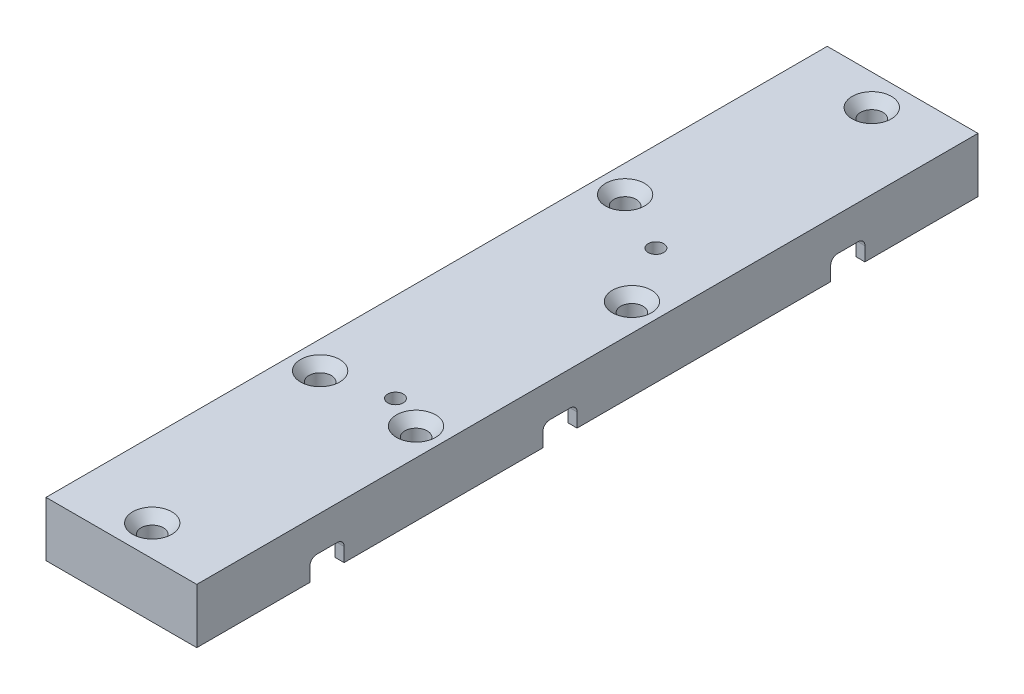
ISO-10303-21;
HEADER;
FILE_DESCRIPTION(('STEP AP214'),'2;1');
FILE_NAME('part.step','',(''),(''),'','','');
FILE_SCHEMA(('AUTOMOTIVE_DESIGN { 1 0 10303 214 1 1 1 1 }'));
ENDSEC;
DATA;
#1=APPLICATION_CONTEXT('core data for automotive mechanical design processes');
#2=APPLICATION_PROTOCOL_DEFINITION('international standard','automotive_design',2000,#1);
#3=PRODUCT_CONTEXT('',#1,'mechanical');
#4=PRODUCT('Part','Part','',(#3));
#5=PRODUCT_RELATED_PRODUCT_CATEGORY('part','',(#4));
#6=PRODUCT_DEFINITION_FORMATION('','',#4);
#7=PRODUCT_DEFINITION_CONTEXT('part definition',#1,'design');
#8=PRODUCT_DEFINITION('design','',#6,#7);
#9=PRODUCT_DEFINITION_SHAPE('','',#8);
#10=(LENGTH_UNIT() NAMED_UNIT(*) SI_UNIT(.MILLI.,.METRE.));
#11=(NAMED_UNIT(*) PLANE_ANGLE_UNIT() SI_UNIT($,.RADIAN.));
#12=(NAMED_UNIT(*) SI_UNIT($,.STERADIAN.) SOLID_ANGLE_UNIT());
#13=UNCERTAINTY_MEASURE_WITH_UNIT(LENGTH_MEASURE(1.E-05),#10,'distance_accuracy_value','');
#14=(GEOMETRIC_REPRESENTATION_CONTEXT(3) GLOBAL_UNCERTAINTY_ASSIGNED_CONTEXT((#13)) GLOBAL_UNIT_ASSIGNED_CONTEXT((#10,
#11,#12)) REPRESENTATION_CONTEXT('',''));
#15=CARTESIAN_POINT('',(0.,0.,0.));
#16=DIRECTION('',(0.,0.,1.));
#17=DIRECTION('',(1.,0.,0.));
#18=AXIS2_PLACEMENT_3D('',#15,#16,#17);
#19=CARTESIAN_POINT('',(11.,0.,-114.));
#20=DIRECTION('',(-1.,0.,0.));
#21=DIRECTION('',(0.,-1.,0.));
#22=AXIS2_PLACEMENT_3D('',#19,#20,#21);
#23=PLANE('',#22);
#24=DIRECTION('',(0.,-1.,0.));
#25=VECTOR('',#24,1.);
#26=CARTESIAN_POINT('',(11.,-4.952,-92.5));
#27=LINE('',#26,#25);
#28=CARTESIAN_POINT('',(11.,-5.952,-92.5));
#29=VERTEX_POINT('',#28);
#30=CARTESIAN_POINT('',(11.,-8.,-92.5));
#31=VERTEX_POINT('',#30);
#32=EDGE_CURVE('E201',#29,#31,#27,.T.);
#33=ORIENTED_EDGE('',*,*,#32,.F.);
#34=CARTESIAN_POINT('',(11.,-5.952,-93.5));
#35=DIRECTION('',(-1.,0.,0.));
#36=DIRECTION('',(0.,-1.,0.));
#37=AXIS2_PLACEMENT_3D('',#34,#35,#36);
#38=CIRCLE('',#37,1.);
#39=CARTESIAN_POINT('',(11.,-4.952,-93.5));
#40=VERTEX_POINT('',#39);
#41=EDGE_CURVE('E517',#29,#40,#38,.T.);
#42=ORIENTED_EDGE('',*,*,#41,.T.);
#43=DIRECTION('',(0.,0.,-1.));
#44=VECTOR('',#43,1.);
#45=CARTESIAN_POINT('',(11.,-4.952,-92.5));
#46=LINE('',#45,#44);
#47=CARTESIAN_POINT('',(11.,-4.952,-96.5));
#48=VERTEX_POINT('',#47);
#49=EDGE_CURVE('E328',#40,#48,#46,.T.);
#50=ORIENTED_EDGE('',*,*,#49,.T.);
#51=CARTESIAN_POINT('',(11.,-5.952,-96.5));
#52=DIRECTION('',(-1.,0.,0.));
#53=DIRECTION('',(0.,-1.,0.));
#54=AXIS2_PLACEMENT_3D('',#51,#52,#53);
#55=CIRCLE('',#54,1.);
#56=CARTESIAN_POINT('',(11.,-5.952,-97.5));
#57=VERTEX_POINT('',#56);
#58=EDGE_CURVE('E544',#48,#57,#55,.T.);
#59=ORIENTED_EDGE('',*,*,#58,.T.);
#60=DIRECTION('',(0.,-1.,0.));
#61=VECTOR('',#60,1.);
#62=CARTESIAN_POINT('',(11.,-4.952,-97.5));
#63=LINE('',#62,#61);
#64=CARTESIAN_POINT('',(11.,-8.,-97.5));
#65=VERTEX_POINT('',#64);
#66=EDGE_CURVE('E211',#57,#65,#63,.T.);
#67=ORIENTED_EDGE('',*,*,#66,.T.);
#68=DIRECTION('',(0.,0.,1.));
#69=VECTOR('',#68,1.);
#70=CARTESIAN_POINT('',(11.,-8.,-114.));
#71=LINE('',#70,#69);
#72=CARTESIAN_POINT('',(11.,-8.,-114.));
#73=VERTEX_POINT('',#72);
#74=EDGE_CURVE('E226',#73,#65,#71,.T.);
#75=ORIENTED_EDGE('',*,*,#74,.F.);
#76=DIRECTION('',(0.,-1.,0.));
#77=VECTOR('',#76,1.);
#78=CARTESIAN_POINT('',(11.,0.,-114.));
#79=LINE('',#78,#77);
#80=CARTESIAN_POINT('',(11.,0.,-114.));
#81=VERTEX_POINT('',#80);
#82=EDGE_CURVE('E246',#81,#73,#79,.T.);
#83=ORIENTED_EDGE('',*,*,#82,.F.);
#84=DIRECTION('',(0.,0.,1.));
#85=VECTOR('',#84,1.);
#86=CARTESIAN_POINT('',(11.,0.,-114.));
#87=LINE('',#86,#85);
#88=CARTESIAN_POINT('',(11.,0.,0.));
#89=VERTEX_POINT('',#88);
#90=EDGE_CURVE('E231',#81,#89,#87,.T.);
#91=ORIENTED_EDGE('',*,*,#90,.T.);
#92=DIRECTION('',(0.,-1.,0.));
#93=VECTOR('',#92,1.);
#94=CARTESIAN_POINT('',(11.,0.,0.));
#95=LINE('',#94,#93);
#96=CARTESIAN_POINT('',(11.,-8.,0.));
#97=VERTEX_POINT('',#96);
#98=EDGE_CURVE('E253',#89,#97,#95,.T.);
#99=ORIENTED_EDGE('',*,*,#98,.T.);
#100=CARTESIAN_POINT('',(11.,-8.,-16.5));
#101=VERTEX_POINT('',#100);
#102=EDGE_CURVE('E229',#101,#97,#71,.T.);
#103=ORIENTED_EDGE('',*,*,#102,.F.);
#104=DIRECTION('',(0.,-1.,0.));
#105=VECTOR('',#104,1.);
#106=CARTESIAN_POINT('',(11.,-4.952,-16.5));
#107=LINE('',#106,#105);
#108=CARTESIAN_POINT('',(11.,-5.952,-16.5));
#109=VERTEX_POINT('',#108);
#110=EDGE_CURVE('E299',#109,#101,#107,.T.);
#111=ORIENTED_EDGE('',*,*,#110,.F.);
#112=CARTESIAN_POINT('',(11.,-5.952,-17.5));
#113=DIRECTION('',(-1.,0.,0.));
#114=DIRECTION('',(0.,-1.,0.));
#115=AXIS2_PLACEMENT_3D('',#112,#113,#114);
#116=CIRCLE('',#115,1.);
#117=CARTESIAN_POINT('',(11.,-4.952,-17.5));
#118=VERTEX_POINT('',#117);
#119=EDGE_CURVE('E463',#109,#118,#116,.T.);
#120=ORIENTED_EDGE('',*,*,#119,.T.);
#121=DIRECTION('',(0.,0.,-1.));
#122=VECTOR('',#121,1.);
#123=CARTESIAN_POINT('',(11.,-4.952,-16.5));
#124=LINE('',#123,#122);
#125=CARTESIAN_POINT('',(11.,-4.952,-20.5));
#126=VERTEX_POINT('',#125);
#127=EDGE_CURVE('E313',#118,#126,#124,.T.);
#128=ORIENTED_EDGE('',*,*,#127,.T.);
#129=CARTESIAN_POINT('',(11.,-5.952,-20.5));
#130=DIRECTION('',(-1.,0.,0.));
#131=DIRECTION('',(0.,-1.,0.));
#132=AXIS2_PLACEMENT_3D('',#129,#130,#131);
#133=CIRCLE('',#132,1.);
#134=CARTESIAN_POINT('',(11.,-5.952,-21.5));
#135=VERTEX_POINT('',#134);
#136=EDGE_CURVE('E545',#126,#135,#133,.T.);
#137=ORIENTED_EDGE('',*,*,#136,.T.);
#138=DIRECTION('',(0.,-1.,0.));
#139=VECTOR('',#138,1.);
#140=CARTESIAN_POINT('',(11.,-4.952,-21.5));
#141=LINE('',#140,#139);
#142=CARTESIAN_POINT('',(11.,-8.,-21.5));
#143=VERTEX_POINT('',#142);
#144=EDGE_CURVE('E303',#135,#143,#141,.T.);
#145=ORIENTED_EDGE('',*,*,#144,.T.);
#146=CARTESIAN_POINT('',(11.,-8.,-50.5));
#147=VERTEX_POINT('',#146);
#148=EDGE_CURVE('E227',#147,#143,#71,.T.);
#149=ORIENTED_EDGE('',*,*,#148,.F.);
#150=DIRECTION('',(0.,-1.,0.));
#151=VECTOR('',#150,1.);
#152=CARTESIAN_POINT('',(11.,-4.952,-50.5));
#153=LINE('',#152,#151);
#154=CARTESIAN_POINT('',(11.,-5.952,-50.5));
#155=VERTEX_POINT('',#154);
#156=EDGE_CURVE('E254',#155,#147,#153,.T.);
#157=ORIENTED_EDGE('',*,*,#156,.F.);
#158=CARTESIAN_POINT('',(11.,-5.952,-51.5));
#159=DIRECTION('',(-1.,0.,0.));
#160=DIRECTION('',(0.,-1.,0.));
#161=AXIS2_PLACEMENT_3D('',#158,#159,#160);
#162=CIRCLE('',#161,1.);
#163=CARTESIAN_POINT('',(11.,-4.952,-51.5));
#164=VERTEX_POINT('',#163);
#165=EDGE_CURVE('E511',#155,#164,#162,.T.);
#166=ORIENTED_EDGE('',*,*,#165,.T.);
#167=DIRECTION('',(0.,0.,-1.));
#168=VECTOR('',#167,1.);
#169=CARTESIAN_POINT('',(11.,-4.952,-50.5));
#170=LINE('',#169,#168);
#171=CARTESIAN_POINT('',(11.,-4.952,-54.5));
#172=VERTEX_POINT('',#171);
#173=EDGE_CURVE('E293',#164,#172,#170,.T.);
#174=ORIENTED_EDGE('',*,*,#173,.T.);
#175=CARTESIAN_POINT('',(11.,-5.952,-54.5));
#176=DIRECTION('',(-1.,0.,0.));
#177=DIRECTION('',(0.,-1.,0.));
#178=AXIS2_PLACEMENT_3D('',#175,#176,#177);
#179=CIRCLE('',#178,1.);
#180=CARTESIAN_POINT('',(11.,-5.952,-55.5));
#181=VERTEX_POINT('',#180);
#182=EDGE_CURVE('E13',#172,#181,#179,.T.);
#183=ORIENTED_EDGE('',*,*,#182,.T.);
#184=DIRECTION('',(0.,-1.,0.));
#185=VECTOR('',#184,1.);
#186=CARTESIAN_POINT('',(11.,-4.952,-55.5));
#187=LINE('',#186,#185);
#188=CARTESIAN_POINT('',(11.,-8.,-55.5));
#189=VERTEX_POINT('',#188);
#190=EDGE_CURVE('E225',#181,#189,#187,.T.);
#191=ORIENTED_EDGE('',*,*,#190,.T.);
#192=EDGE_CURVE('E217',#31,#189,#71,.T.);
#193=ORIENTED_EDGE('',*,*,#192,.F.);
#194=EDGE_LOOP('',(#33,#42,#50,#59,#67,#75,#83,#91,#99,#103,#111,#120,#128,#137,#145,#149,#157,
#166,#174,#183,#191,#193));
#195=FACE_BOUND('',#194,.T.);
#196=ADVANCED_FACE('F50',(#195),#23,.F.);
#197=CARTESIAN_POINT('',(-11.,-8.,-114.));
#198=DIRECTION('',(0.,-1.,0.));
#199=DIRECTION('',(1.,0.,0.));
#200=AXIS2_PLACEMENT_3D('',#197,#198,#199);
#201=PLANE('',#200);
#202=CARTESIAN_POINT('',(1.99999999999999,-8.,-76.));
#203=DIRECTION('',(0.,1.,0.));
#204=DIRECTION('',(0.,0.,1.));
#205=AXIS2_PLACEMENT_3D('',#202,#203,#204);
#206=CIRCLE('',#205,1.1303);
#207=CARTESIAN_POINT('',(1.99999999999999,-8.,-74.8697));
#208=VERTEX_POINT('',#207);
#209=EDGE_CURVE('E392',#208,#208,#206,.T.);
#210=ORIENTED_EDGE('',*,*,#209,.T.);
#211=EDGE_LOOP('',(#210));
#212=FACE_BOUND('',#211,.T.);
#213=CARTESIAN_POINT('',(1.99999999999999,-8.,-38.));
#214=DIRECTION('',(0.,1.,0.));
#215=DIRECTION('',(0.,0.,1.));
#216=AXIS2_PLACEMENT_3D('',#213,#214,#215);
#217=CIRCLE('',#216,1.1303);
#218=CARTESIAN_POINT('',(1.99999999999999,-8.,-36.8697));
#219=VERTEX_POINT('',#218);
#220=EDGE_CURVE('E386',#219,#219,#217,.T.);
#221=ORIENTED_EDGE('',*,*,#220,.T.);
#222=EDGE_LOOP('',(#221));
#223=FACE_BOUND('',#222,.T.);
#224=CARTESIAN_POINT('',(0.,-8.,-4.5));
#225=DIRECTION('',(0.,1.,0.));
#226=DIRECTION('',(0.,0.,1.));
#227=AXIS2_PLACEMENT_3D('',#224,#225,#226);
#228=CIRCLE('',#227,1.63195);
#229=CARTESIAN_POINT('',(0.,-8.,-2.86805));
#230=VERTEX_POINT('',#229);
#231=EDGE_CURVE('E377',#230,#230,#228,.T.);
#232=ORIENTED_EDGE('',*,*,#231,.T.);
#233=EDGE_LOOP('',(#232));
#234=FACE_BOUND('',#233,.T.);
#235=CARTESIAN_POINT('',(0.,-8.,-109.5));
#236=DIRECTION('',(0.,1.,0.));
#237=DIRECTION('',(0.,0.,1.));
#238=AXIS2_PLACEMENT_3D('',#235,#236,#237);
#239=CIRCLE('',#238,1.63195);
#240=CARTESIAN_POINT('',(0.,-8.,-107.86805));
#241=VERTEX_POINT('',#240);
#242=EDGE_CURVE('E368',#241,#241,#239,.T.);
#243=ORIENTED_EDGE('',*,*,#242,.T.);
#244=EDGE_LOOP('',(#243));
#245=FACE_BOUND('',#244,.T.);
#246=CARTESIAN_POINT('',(7.,-8.,-36.));
#247=DIRECTION('',(0.,1.,0.));
#248=DIRECTION('',(0.,0.,1.));
#249=AXIS2_PLACEMENT_3D('',#246,#247,#248);
#250=CIRCLE('',#249,1.63195);
#251=CARTESIAN_POINT('',(7.,-8.,-34.36805));
#252=VERTEX_POINT('',#251);
#253=EDGE_CURVE('E359',#252,#252,#250,.T.);
#254=ORIENTED_EDGE('',*,*,#253,.T.);
#255=EDGE_LOOP('',(#254));
#256=FACE_BOUND('',#255,.T.);
#257=CARTESIAN_POINT('',(-7.,-8.,-80.5));
#258=DIRECTION('',(0.,1.,0.));
#259=DIRECTION('',(0.,0.,1.));
#260=AXIS2_PLACEMENT_3D('',#257,#258,#259);
#261=CIRCLE('',#260,1.63195);
#262=CARTESIAN_POINT('',(-7.,-8.,-78.86805));
#263=VERTEX_POINT('',#262);
#264=EDGE_CURVE('E350',#263,#263,#261,.T.);
#265=ORIENTED_EDGE('',*,*,#264,.T.);
#266=EDGE_LOOP('',(#265));
#267=FACE_BOUND('',#266,.T.);
#268=CARTESIAN_POINT('',(7.,-8.,-67.5));
#269=DIRECTION('',(0.,1.,0.));
#270=DIRECTION('',(0.,0.,1.));
#271=AXIS2_PLACEMENT_3D('',#268,#269,#270);
#272=CIRCLE('',#271,1.63195);
#273=CARTESIAN_POINT('',(7.,-8.,-65.86805));
#274=VERTEX_POINT('',#273);
#275=EDGE_CURVE('E341',#274,#274,#272,.T.);
#276=ORIENTED_EDGE('',*,*,#275,.T.);
#277=EDGE_LOOP('',(#276));
#278=FACE_BOUND('',#277,.T.);
#279=CARTESIAN_POINT('',(-7.,-8.,-36.));
#280=DIRECTION('',(0.,1.,0.));
#281=DIRECTION('',(0.,0.,1.));
#282=AXIS2_PLACEMENT_3D('',#279,#280,#281);
#283=CIRCLE('',#282,1.63195);
#284=CARTESIAN_POINT('',(-7.,-8.,-34.36805));
#285=VERTEX_POINT('',#284);
#286=EDGE_CURVE('E223',#285,#285,#283,.T.);
#287=ORIENTED_EDGE('',*,*,#286,.T.);
#288=EDGE_LOOP('',(#287));
#289=FACE_BOUND('',#288,.T.);
#290=CARTESIAN_POINT('',(0.,-8.,-95.));
#291=DIRECTION('',(0.,1.,0.));
#292=DIRECTION('',(-1.,0.,0.));
#293=AXIS2_PLACEMENT_3D('',#290,#291,#292);
#294=CIRCLE('',#293,10.);
#295=CARTESIAN_POINT('',(9.68245836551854,-8.,-97.5));
#296=VERTEX_POINT('',#295);
#297=CARTESIAN_POINT('',(9.68245836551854,-8.,-92.5));
#298=VERTEX_POINT('',#297);
#299=EDGE_CURVE('E221',#296,#298,#294,.T.);
#300=ORIENTED_EDGE('',*,*,#299,.T.);
#301=DIRECTION('',(1.,0.,0.));
#302=VECTOR('',#301,1.);
#303=CARTESIAN_POINT('',(9.68245836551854,-8.,-92.5));
#304=LINE('',#303,#302);
#305=EDGE_CURVE('E205',#298,#31,#304,.T.);
#306=ORIENTED_EDGE('',*,*,#305,.T.);
#307=ORIENTED_EDGE('',*,*,#192,.T.);
#308=DIRECTION('',(-1.,0.,0.));
#309=VECTOR('',#308,1.);
#310=CARTESIAN_POINT('',(11.,-8.,-55.5));
#311=LINE('',#310,#309);
#312=CARTESIAN_POINT('',(9.68245836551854,-8.,-55.5));
#313=VERTEX_POINT('',#312);
#314=EDGE_CURVE('E294',#189,#313,#311,.T.);
#315=ORIENTED_EDGE('',*,*,#314,.T.);
#316=CARTESIAN_POINT('',(0.,-8.,-53.));
#317=DIRECTION('',(0.,1.,0.));
#318=DIRECTION('',(-1.,0.,0.));
#319=AXIS2_PLACEMENT_3D('',#316,#317,#318);
#320=CIRCLE('',#319,10.);
#321=CARTESIAN_POINT('',(9.68245836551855,-8.,-50.5));
#322=VERTEX_POINT('',#321);
#323=EDGE_CURVE('E290',#313,#322,#320,.T.);
#324=ORIENTED_EDGE('',*,*,#323,.T.);
#325=DIRECTION('',(1.,0.,0.));
#326=VECTOR('',#325,1.);
#327=CARTESIAN_POINT('',(9.68245836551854,-8.,-50.5));
#328=LINE('',#327,#326);
#329=EDGE_CURVE('E296',#322,#147,#328,.T.);
#330=ORIENTED_EDGE('',*,*,#329,.T.);
#331=ORIENTED_EDGE('',*,*,#148,.T.);
#332=DIRECTION('',(-1.,0.,0.));
#333=VECTOR('',#332,1.);
#334=CARTESIAN_POINT('',(11.,-8.,-21.5));
#335=LINE('',#334,#333);
#336=CARTESIAN_POINT('',(9.68245836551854,-8.,-21.5));
#337=VERTEX_POINT('',#336);
#338=EDGE_CURVE('E314',#143,#337,#335,.T.);
#339=ORIENTED_EDGE('',*,*,#338,.T.);
#340=CARTESIAN_POINT('',(0.,-8.,-19.));
#341=DIRECTION('',(0.,1.,0.));
#342=DIRECTION('',(-1.,0.,0.));
#343=AXIS2_PLACEMENT_3D('',#340,#341,#342);
#344=CIRCLE('',#343,10.);
#345=CARTESIAN_POINT('',(9.68245836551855,-8.,-16.5));
#346=VERTEX_POINT('',#345);
#347=EDGE_CURVE('E310',#337,#346,#344,.T.);
#348=ORIENTED_EDGE('',*,*,#347,.T.);
#349=DIRECTION('',(1.,0.,0.));
#350=VECTOR('',#349,1.);
#351=CARTESIAN_POINT('',(9.68245836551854,-8.,-16.5));
#352=LINE('',#351,#350);
#353=EDGE_CURVE('E210',#346,#101,#352,.T.);
#354=ORIENTED_EDGE('',*,*,#353,.T.);
#355=ORIENTED_EDGE('',*,*,#102,.T.);
#356=DIRECTION('',(1.,0.,0.));
#357=VECTOR('',#356,1.);
#358=CARTESIAN_POINT('',(-11.,-8.,0.));
#359=LINE('',#358,#357);
#360=CARTESIAN_POINT('',(-11.,-8.,0.));
#361=VERTEX_POINT('',#360);
#362=EDGE_CURVE('E250',#361,#97,#359,.T.);
#363=ORIENTED_EDGE('',*,*,#362,.F.);
#364=DIRECTION('',(0.,0.,1.));
#365=VECTOR('',#364,1.);
#366=CARTESIAN_POINT('',(-11.,-8.,-114.));
#367=LINE('',#366,#365);
#368=CARTESIAN_POINT('',(-11.,-8.,-114.));
#369=VERTEX_POINT('',#368);
#370=EDGE_CURVE('E261',#369,#361,#367,.T.);
#371=ORIENTED_EDGE('',*,*,#370,.F.);
#372=DIRECTION('',(1.,0.,0.));
#373=VECTOR('',#372,1.);
#374=CARTESIAN_POINT('',(-11.,-8.,-114.));
#375=LINE('',#374,#373);
#376=EDGE_CURVE('E260',#369,#73,#375,.T.);
#377=ORIENTED_EDGE('',*,*,#376,.T.);
#378=ORIENTED_EDGE('',*,*,#74,.T.);
#379=DIRECTION('',(-1.,0.,0.));
#380=VECTOR('',#379,1.);
#381=CARTESIAN_POINT('',(11.,-8.,-97.5));
#382=LINE('',#381,#380);
#383=EDGE_CURVE('E222',#65,#296,#382,.T.);
#384=ORIENTED_EDGE('',*,*,#383,.T.);
#385=EDGE_LOOP('',(#300,#306,#307,#315,#324,#330,#331,#339,#348,#354,#355,#363,#371,#377,#378,#384));
#386=FACE_BOUND('',#385,.T.);
#387=ADVANCED_FACE('F215',(#212,#223,#234,#245,#256,#267,#278,#289,#386),#201,.T.);
#388=CARTESIAN_POINT('',(-11.,-8.,-114.));
#389=DIRECTION('',(1.,0.,0.));
#390=DIRECTION('',(0.,1.,0.));
#391=AXIS2_PLACEMENT_3D('',#388,#389,#390);
#392=PLANE('',#391);
#393=DIRECTION('',(0.,1.,0.));
#394=VECTOR('',#393,1.);
#395=CARTESIAN_POINT('',(-11.,-8.,0.));
#396=LINE('',#395,#394);
#397=CARTESIAN_POINT('',(-11.,0.,0.));
#398=VERTEX_POINT('',#397);
#399=EDGE_CURVE('E258',#361,#398,#396,.T.);
#400=ORIENTED_EDGE('',*,*,#399,.T.);
#401=DIRECTION('',(0.,0.,1.));
#402=VECTOR('',#401,1.);
#403=CARTESIAN_POINT('',(-11.,0.,-114.));
#404=LINE('',#403,#402);
#405=CARTESIAN_POINT('',(-11.,0.,-114.));
#406=VERTEX_POINT('',#405);
#407=EDGE_CURVE('E264',#406,#398,#404,.T.);
#408=ORIENTED_EDGE('',*,*,#407,.F.);
#409=DIRECTION('',(0.,1.,0.));
#410=VECTOR('',#409,1.);
#411=CARTESIAN_POINT('',(-11.,-8.,-114.));
#412=LINE('',#411,#410);
#413=EDGE_CURVE('E235',#369,#406,#412,.T.);
#414=ORIENTED_EDGE('',*,*,#413,.F.);
#415=ORIENTED_EDGE('',*,*,#370,.T.);
#416=EDGE_LOOP('',(#400,#408,#414,#415));
#417=FACE_BOUND('',#416,.T.);
#418=ADVANCED_FACE('F279',(#417),#392,.F.);
#419=CARTESIAN_POINT('',(-11.,0.,-114.));
#420=DIRECTION('',(0.,-1.,0.));
#421=DIRECTION('',(1.,0.,0.));
#422=AXIS2_PLACEMENT_3D('',#419,#420,#421);
#423=PLANE('',#422);
#424=CARTESIAN_POINT('',(1.99999999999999,0.,-76.));
#425=DIRECTION('',(0.,1.,0.));
#426=DIRECTION('',(0.,0.,1.));
#427=AXIS2_PLACEMENT_3D('',#424,#425,#426);
#428=CIRCLE('',#427,1.1303);
#429=CARTESIAN_POINT('',(1.99999999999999,0.,-74.8697));
#430=VERTEX_POINT('',#429);
#431=EDGE_CURVE('E395',#430,#430,#428,.T.);
#432=ORIENTED_EDGE('',*,*,#431,.F.);
#433=EDGE_LOOP('',(#432));
#434=FACE_BOUND('',#433,.T.);
#435=CARTESIAN_POINT('',(1.99999999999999,0.,-38.));
#436=DIRECTION('',(0.,1.,0.));
#437=DIRECTION('',(0.,0.,1.));
#438=AXIS2_PLACEMENT_3D('',#435,#436,#437);
#439=CIRCLE('',#438,1.1303);
#440=CARTESIAN_POINT('',(1.99999999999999,0.,-36.8697));
#441=VERTEX_POINT('',#440);
#442=EDGE_CURVE('E389',#441,#441,#439,.T.);
#443=ORIENTED_EDGE('',*,*,#442,.F.);
#444=EDGE_LOOP('',(#443));
#445=FACE_BOUND('',#444,.T.);
#446=CARTESIAN_POINT('',(0.,0.,-4.5));
#447=DIRECTION('',(0.,1.,0.));
#448=DIRECTION('',(0.,0.,1.));
#449=AXIS2_PLACEMENT_3D('',#446,#447,#448);
#450=CIRCLE('',#449,2.8575);
#451=CARTESIAN_POINT('',(0.,0.,-1.6425));
#452=VERTEX_POINT('',#451);
#453=EDGE_CURVE('E383',#452,#452,#450,.T.);
#454=ORIENTED_EDGE('',*,*,#453,.F.);
#455=EDGE_LOOP('',(#454));
#456=FACE_BOUND('',#455,.T.);
#457=CARTESIAN_POINT('',(0.,0.,-109.5));
#458=DIRECTION('',(0.,1.,0.));
#459=DIRECTION('',(0.,0.,1.));
#460=AXIS2_PLACEMENT_3D('',#457,#458,#459);
#461=CIRCLE('',#460,2.8575);
#462=CARTESIAN_POINT('',(0.,0.,-106.6425));
#463=VERTEX_POINT('',#462);
#464=EDGE_CURVE('E374',#463,#463,#461,.T.);
#465=ORIENTED_EDGE('',*,*,#464,.F.);
#466=EDGE_LOOP('',(#465));
#467=FACE_BOUND('',#466,.T.);
#468=CARTESIAN_POINT('',(7.,0.,-36.));
#469=DIRECTION('',(0.,1.,0.));
#470=DIRECTION('',(0.,0.,1.));
#471=AXIS2_PLACEMENT_3D('',#468,#469,#470);
#472=CIRCLE('',#471,2.8575);
#473=CARTESIAN_POINT('',(7.,0.,-33.1425));
#474=VERTEX_POINT('',#473);
#475=EDGE_CURVE('E365',#474,#474,#472,.T.);
#476=ORIENTED_EDGE('',*,*,#475,.F.);
#477=EDGE_LOOP('',(#476));
#478=FACE_BOUND('',#477,.T.);
#479=CARTESIAN_POINT('',(-7.,0.,-80.5));
#480=DIRECTION('',(0.,1.,0.));
#481=DIRECTION('',(0.,0.,1.));
#482=AXIS2_PLACEMENT_3D('',#479,#480,#481);
#483=CIRCLE('',#482,2.8575);
#484=CARTESIAN_POINT('',(-7.,0.,-77.6425));
#485=VERTEX_POINT('',#484);
#486=EDGE_CURVE('E356',#485,#485,#483,.T.);
#487=ORIENTED_EDGE('',*,*,#486,.F.);
#488=EDGE_LOOP('',(#487));
#489=FACE_BOUND('',#488,.T.);
#490=CARTESIAN_POINT('',(7.,0.,-67.5));
#491=DIRECTION('',(0.,1.,0.));
#492=DIRECTION('',(0.,0.,1.));
#493=AXIS2_PLACEMENT_3D('',#490,#491,#492);
#494=CIRCLE('',#493,2.8575);
#495=CARTESIAN_POINT('',(7.,0.,-64.6425));
#496=VERTEX_POINT('',#495);
#497=EDGE_CURVE('E347',#496,#496,#494,.T.);
#498=ORIENTED_EDGE('',*,*,#497,.F.);
#499=EDGE_LOOP('',(#498));
#500=FACE_BOUND('',#499,.T.);
#501=CARTESIAN_POINT('',(-7.,0.,-36.));
#502=DIRECTION('',(0.,1.,0.));
#503=DIRECTION('',(0.,0.,1.));
#504=AXIS2_PLACEMENT_3D('',#501,#502,#503);
#505=CIRCLE('',#504,2.8575);
#506=CARTESIAN_POINT('',(-7.,0.,-33.1425));
#507=VERTEX_POINT('',#506);
#508=EDGE_CURVE('E338',#507,#507,#505,.T.);
#509=ORIENTED_EDGE('',*,*,#508,.F.);
#510=EDGE_LOOP('',(#509));
#511=FACE_BOUND('',#510,.T.);
#512=DIRECTION('',(1.,0.,0.));
#513=VECTOR('',#512,1.);
#514=CARTESIAN_POINT('',(-11.,0.,0.));
#515=LINE('',#514,#513);
#516=EDGE_CURVE('E256',#398,#89,#515,.T.);
#517=ORIENTED_EDGE('',*,*,#516,.T.);
#518=ORIENTED_EDGE('',*,*,#90,.F.);
#519=DIRECTION('',(1.,0.,0.));
#520=VECTOR('',#519,1.);
#521=CARTESIAN_POINT('',(-11.,0.,-114.));
#522=LINE('',#521,#520);
#523=EDGE_CURVE('E240',#406,#81,#522,.T.);
#524=ORIENTED_EDGE('',*,*,#523,.F.);
#525=ORIENTED_EDGE('',*,*,#407,.T.);
#526=EDGE_LOOP('',(#517,#518,#524,#525));
#527=FACE_BOUND('',#526,.T.);
#528=ADVANCED_FACE('F401',(#434,#445,#456,#467,#478,#489,#500,#511,#527),#423,.F.);
#529=CARTESIAN_POINT('',(0.,0.,-114.));
#530=DIRECTION('',(0.,0.,-1.));
#531=DIRECTION('',(-1.,0.,0.));
#532=AXIS2_PLACEMENT_3D('',#529,#530,#531);
#533=PLANE('',#532);
#534=ORIENTED_EDGE('',*,*,#376,.F.);
#535=ORIENTED_EDGE('',*,*,#413,.T.);
#536=ORIENTED_EDGE('',*,*,#523,.T.);
#537=ORIENTED_EDGE('',*,*,#82,.T.);
#538=EDGE_LOOP('',(#534,#535,#536,#537));
#539=FACE_BOUND('',#538,.T.);
#540=ADVANCED_FACE('F280',(#539),#533,.T.);
#541=CARTESIAN_POINT('',(0.,0.,0.));
#542=DIRECTION('',(0.,0.,-1.));
#543=DIRECTION('',(-1.,0.,0.));
#544=AXIS2_PLACEMENT_3D('',#541,#542,#543);
#545=PLANE('',#544);
#546=ORIENTED_EDGE('',*,*,#362,.T.);
#547=ORIENTED_EDGE('',*,*,#98,.F.);
#548=ORIENTED_EDGE('',*,*,#516,.F.);
#549=ORIENTED_EDGE('',*,*,#399,.F.);
#550=EDGE_LOOP('',(#546,#547,#548,#549));
#551=FACE_BOUND('',#550,.T.);
#552=ADVANCED_FACE('F275',(#551),#545,.F.);
#553=CARTESIAN_POINT('',(9.68245836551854,-4.952,-50.5));
#554=DIRECTION('',(0.,0.,-1.));
#555=DIRECTION('',(-1.,0.,0.));
#556=AXIS2_PLACEMENT_3D('',#553,#554,#555);
#557=PLANE('',#556);
#558=DIRECTION('',(0.,-1.,0.));
#559=VECTOR('',#558,1.);
#560=CARTESIAN_POINT('',(9.68245836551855,-4.952,-50.5));
#561=LINE('',#560,#559);
#562=CARTESIAN_POINT('',(9.68245836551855,-5.952,-50.5));
#563=VERTEX_POINT('',#562);
#564=EDGE_CURVE('E287',#563,#322,#561,.T.);
#565=ORIENTED_EDGE('',*,*,#564,.F.);
#566=DIRECTION('',(1.,0.,0.));
#567=VECTOR('',#566,1.);
#568=CARTESIAN_POINT('',(9.68245836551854,-5.952,-50.5));
#569=LINE('',#568,#567);
#570=EDGE_CURVE('E577',#563,#155,#569,.T.);
#571=ORIENTED_EDGE('',*,*,#570,.T.);
#572=ORIENTED_EDGE('',*,*,#156,.T.);
#573=ORIENTED_EDGE('',*,*,#329,.F.);
#574=EDGE_LOOP('',(#565,#571,#572,#573));
#575=FACE_BOUND('',#574,.T.);
#576=ADVANCED_FACE('F612',(#575),#557,.T.);
#577=CARTESIAN_POINT('',(11.,-4.952,-55.5));
#578=DIRECTION('',(0.,0.,1.));
#579=DIRECTION('',(1.,0.,0.));
#580=AXIS2_PLACEMENT_3D('',#577,#578,#579);
#581=PLANE('',#580);
#582=ORIENTED_EDGE('',*,*,#190,.F.);
#583=DIRECTION('',(-1.,0.,0.));
#584=VECTOR('',#583,1.);
#585=CARTESIAN_POINT('',(11.,-5.952,-55.5));
#586=LINE('',#585,#584);
#587=CARTESIAN_POINT('',(9.68245836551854,-5.952,-55.5));
#588=VERTEX_POINT('',#587);
#589=EDGE_CURVE('E584',#181,#588,#586,.T.);
#590=ORIENTED_EDGE('',*,*,#589,.T.);
#591=DIRECTION('',(0.,-1.,0.));
#592=VECTOR('',#591,1.);
#593=CARTESIAN_POINT('',(9.68245836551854,-4.952,-55.5));
#594=LINE('',#593,#592);
#595=EDGE_CURVE('E285',#588,#313,#594,.T.);
#596=ORIENTED_EDGE('',*,*,#595,.T.);
#597=ORIENTED_EDGE('',*,*,#314,.F.);
#598=EDGE_LOOP('',(#582,#590,#596,#597));
#599=FACE_BOUND('',#598,.T.);
#600=ADVANCED_FACE('F495',(#599),#581,.T.);
#601=CARTESIAN_POINT('',(0.,-4.952,-53.));
#602=DIRECTION('',(0.,-1.,0.));
#603=DIRECTION('',(1.,0.,0.));
#604=AXIS2_PLACEMENT_3D('',#601,#602,#603);
#605=CYLINDRICAL_SURFACE('',#604,10.);
#606=ORIENTED_EDGE('',*,*,#323,.F.);
#607=ORIENTED_EDGE('',*,*,#595,.F.);
#608=CARTESIAN_POINT('',(9.68245836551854,-5.952,-55.5));
#609=CARTESIAN_POINT('',(9.68245759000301,-5.92443750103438,-55.5000003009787));
#610=CARTESIAN_POINT('',(9.68275285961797,-5.89688852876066,-55.4988597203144));
#611=CARTESIAN_POINT('',(9.68392545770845,-5.84199439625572,-55.4943127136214));
#612=CARTESIAN_POINT('',(9.68480270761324,-5.81464920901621,-55.4909065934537));
#613=CARTESIAN_POINT('',(9.6882862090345,-5.73332022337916,-55.4773378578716));
#614=CARTESIAN_POINT('',(9.69174432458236,-5.67989194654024,-55.4638246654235));
#615=CARTESIAN_POINT('',(9.7007043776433,-5.57615352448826,-55.428305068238));
#616=CARTESIAN_POINT('',(9.70620644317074,-5.52584357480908,-55.4062981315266));
#617=CARTESIAN_POINT('',(9.71890686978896,-5.42964520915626,-55.3544762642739));
#618=CARTESIAN_POINT('',(9.72610550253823,-5.38375750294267,-55.3246600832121));
#619=CARTESIAN_POINT('',(9.74190664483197,-5.29686090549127,-55.2575340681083));
#620=CARTESIAN_POINT('',(9.75053057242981,-5.25594618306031,-55.2201075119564));
#621=CARTESIAN_POINT('',(9.7686160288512,-5.18091901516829,-55.1391259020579));
#622=CARTESIAN_POINT('',(9.77807779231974,-5.14680848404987,-55.095569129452));
#623=CARTESIAN_POINT('',(9.79761506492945,-5.08543770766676,-55.002265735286));
#624=CARTESIAN_POINT('',(9.8077002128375,-5.05838443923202,-54.9523850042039));
#625=CARTESIAN_POINT('',(9.82775900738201,-5.01308760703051,-54.8487649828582));
#626=CARTESIAN_POINT('',(9.8377327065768,-4.99483970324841,-54.795027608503));
#627=CARTESIAN_POINT('',(9.85436346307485,-4.97155791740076,-54.7009132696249));
#628=CARTESIAN_POINT('',(9.86115335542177,-4.9642375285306,-54.6611101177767));
#629=CARTESIAN_POINT('',(9.87433325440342,-4.95445753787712,-54.5808905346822));
#630=CARTESIAN_POINT('',(9.88072367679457,-4.9519927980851,-54.5404747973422));
#631=CARTESIAN_POINT('',(9.88685996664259,-4.952,-54.5));
#632=B_SPLINE_CURVE_WITH_KNOTS('',3,(#608,#609,#610,#611,#612,#613,#614,#615,#616,#617,#618,
#619,#620,#621,#622,#623,#624,#625,#626,#627,#628,#629,#630,#631),.UNSPECIFIED.,.F.,.F.,(4,2,2,
2,2,2,2,2,2,2,2,4),(0.,0.0826356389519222,0.165260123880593,0.330061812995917,0.494873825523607,
0.659712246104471,0.827300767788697,0.994936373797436,1.16704315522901,1.33906502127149,
1.4618946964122,1.58459432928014),.UNSPECIFIED.);
#633=CARTESIAN_POINT('',(9.88685996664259,-4.952,-54.5));
#634=VERTEX_POINT('',#633);
#635=EDGE_CURVE('E59',#588,#634,#632,.T.);
#636=ORIENTED_EDGE('',*,*,#635,.T.);
#637=CARTESIAN_POINT('',(0.,-4.952,-53.));
#638=DIRECTION('',(0.,1.,0.));
#639=DIRECTION('',(-1.,0.,0.));
#640=AXIS2_PLACEMENT_3D('',#637,#638,#639);
#641=CIRCLE('',#640,10.);
#642=CARTESIAN_POINT('',(9.88685996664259,-4.952,-51.5));
#643=VERTEX_POINT('',#642);
#644=EDGE_CURVE('E289',#634,#643,#641,.T.);
#645=ORIENTED_EDGE('',*,*,#644,.T.);
#646=CARTESIAN_POINT('',(9.88685996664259,-4.952,-51.5));
#647=CARTESIAN_POINT('',(9.87821043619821,-4.95195715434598,-51.4428619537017));
#648=CARTESIAN_POINT('',(9.86903243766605,-4.95689395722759,-51.3858304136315));
#649=CARTESIAN_POINT('',(9.85000631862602,-4.97631898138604,-51.273584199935));
#650=CARTESIAN_POINT('',(9.84015881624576,-4.9907984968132,-51.2183679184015));
#651=CARTESIAN_POINT('',(9.82016141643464,-5.02890616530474,-51.1112358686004));
#652=CARTESIAN_POINT('',(9.8100114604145,-5.05253610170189,-51.0593207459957));
#653=CARTESIAN_POINT('',(9.78988625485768,-5.10827398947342,-50.9602258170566));
#654=CARTESIAN_POINT('',(9.77991099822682,-5.14038159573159,-50.9130458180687));
#655=CARTESIAN_POINT('',(9.76061284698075,-5.21236614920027,-50.8245689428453));
#656=CARTESIAN_POINT('',(9.75129259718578,-5.25227238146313,-50.7832952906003));
#657=CARTESIAN_POINT('',(9.73388441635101,-5.33871914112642,-50.7080600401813));
#658=CARTESIAN_POINT('',(9.7257966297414,-5.38526044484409,-50.674099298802));
#659=CARTESIAN_POINT('',(9.71147205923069,-5.48296968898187,-50.614999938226));
#660=CARTESIAN_POINT('',(9.70521037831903,-5.5340616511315,-50.5897417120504));
#661=CARTESIAN_POINT('',(9.69480820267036,-5.63996163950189,-50.5482341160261));
#662=CARTESIAN_POINT('',(9.69066561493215,-5.69476593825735,-50.5319758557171));
#663=CARTESIAN_POINT('',(9.68598427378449,-5.78368122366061,-50.5136861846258));
#664=CARTESIAN_POINT('',(9.68466506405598,-5.81714519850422,-50.508557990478));
#665=CARTESIAN_POINT('',(9.68290132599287,-5.88440039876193,-50.5017153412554));
#666=CARTESIAN_POINT('',(9.68245570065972,-5.91819116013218,-50.4999966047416));
#667=CARTESIAN_POINT('',(9.68245836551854,-5.952,-50.5));
#668=B_SPLINE_CURVE_WITH_KNOTS('',3,(#646,#647,#648,#649,#650,#651,#652,#653,#654,#655,#656,
#657,#658,#659,#660,#661,#662,#663,#664,#665,#666,#667),.UNSPECIFIED.,.F.,.F.,(4,2,2,2,2,2,2,2,
2,2,4),(0.,0.173117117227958,0.346076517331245,0.519069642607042,0.692055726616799,
0.865704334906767,1.03937327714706,1.21055000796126,1.38155734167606,1.48302972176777,
1.58437459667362),.UNSPECIFIED.);
#669=EDGE_CURVE('E500',#643,#563,#668,.T.);
#670=ORIENTED_EDGE('',*,*,#669,.T.);
#671=ORIENTED_EDGE('',*,*,#564,.T.);
#672=EDGE_LOOP('',(#606,#607,#636,#645,#670,#671));
#673=FACE_BOUND('',#672,.T.);
#674=ADVANCED_FACE('F490',(#673),#605,.F.);
#675=CARTESIAN_POINT('',(0.,-4.952,-53.));
#676=DIRECTION('',(0.,1.,0.));
#677=DIRECTION('',(-1.,0.,0.));
#678=AXIS2_PLACEMENT_3D('',#675,#676,#677);
#679=PLANE('',#678);
#680=ORIENTED_EDGE('',*,*,#173,.F.);
#681=DIRECTION('',(1.,0.,0.));
#682=VECTOR('',#681,1.);
#683=CARTESIAN_POINT('',(0.,-4.952,-51.5));
#684=LINE('',#683,#682);
#685=EDGE_CURVE('E582',#164,#643,#684,.F.);
#686=ORIENTED_EDGE('',*,*,#685,.T.);
#687=ORIENTED_EDGE('',*,*,#644,.F.);
#688=DIRECTION('',(-1.,0.,0.));
#689=VECTOR('',#688,1.);
#690=CARTESIAN_POINT('',(0.,-4.952,-54.5));
#691=LINE('',#690,#689);
#692=EDGE_CURVE('E580',#634,#172,#691,.F.);
#693=ORIENTED_EDGE('',*,*,#692,.T.);
#694=EDGE_LOOP('',(#680,#686,#687,#693));
#695=FACE_BOUND('',#694,.T.);
#696=ADVANCED_FACE('F486',(#695),#679,.F.);
#697=CARTESIAN_POINT('',(9.68245836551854,-4.952,-16.5));
#698=DIRECTION('',(0.,0.,-1.));
#699=DIRECTION('',(-1.,0.,0.));
#700=AXIS2_PLACEMENT_3D('',#697,#698,#699);
#701=PLANE('',#700);
#702=DIRECTION('',(0.,-1.,0.));
#703=VECTOR('',#702,1.);
#704=CARTESIAN_POINT('',(9.68245836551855,-4.952,-16.5));
#705=LINE('',#704,#703);
#706=CARTESIAN_POINT('',(9.68245836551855,-5.952,-16.5));
#707=VERTEX_POINT('',#706);
#708=EDGE_CURVE('E307',#707,#346,#705,.T.);
#709=ORIENTED_EDGE('',*,*,#708,.F.);
#710=DIRECTION('',(1.,0.,0.));
#711=VECTOR('',#710,1.);
#712=CARTESIAN_POINT('',(9.68245836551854,-5.952,-16.5));
#713=LINE('',#712,#711);
#714=EDGE_CURVE('E263',#707,#109,#713,.T.);
#715=ORIENTED_EDGE('',*,*,#714,.T.);
#716=ORIENTED_EDGE('',*,*,#110,.T.);
#717=ORIENTED_EDGE('',*,*,#353,.F.);
#718=EDGE_LOOP('',(#709,#715,#716,#717));
#719=FACE_BOUND('',#718,.T.);
#720=ADVANCED_FACE('F482',(#719),#701,.T.);
#721=CARTESIAN_POINT('',(11.,-4.952,-21.5));
#722=DIRECTION('',(0.,0.,1.));
#723=DIRECTION('',(1.,0.,0.));
#724=AXIS2_PLACEMENT_3D('',#721,#722,#723);
#725=PLANE('',#724);
#726=ORIENTED_EDGE('',*,*,#144,.F.);
#727=DIRECTION('',(-1.,0.,0.));
#728=VECTOR('',#727,1.);
#729=CARTESIAN_POINT('',(11.,-5.952,-21.5));
#730=LINE('',#729,#728);
#731=CARTESIAN_POINT('',(9.68245836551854,-5.952,-21.5));
#732=VERTEX_POINT('',#731);
#733=EDGE_CURVE('E572',#135,#732,#730,.T.);
#734=ORIENTED_EDGE('',*,*,#733,.T.);
#735=DIRECTION('',(0.,-1.,0.));
#736=VECTOR('',#735,1.);
#737=CARTESIAN_POINT('',(9.68245836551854,-4.952,-21.5));
#738=LINE('',#737,#736);
#739=EDGE_CURVE('E305',#732,#337,#738,.T.);
#740=ORIENTED_EDGE('',*,*,#739,.T.);
#741=ORIENTED_EDGE('',*,*,#338,.F.);
#742=EDGE_LOOP('',(#726,#734,#740,#741));
#743=FACE_BOUND('',#742,.T.);
#744=ADVANCED_FACE('F476',(#743),#725,.T.);
#745=CARTESIAN_POINT('',(0.,-4.952,-19.));
#746=DIRECTION('',(0.,-1.,0.));
#747=DIRECTION('',(1.,0.,0.));
#748=AXIS2_PLACEMENT_3D('',#745,#746,#747);
#749=CYLINDRICAL_SURFACE('',#748,10.);
#750=ORIENTED_EDGE('',*,*,#347,.F.);
#751=ORIENTED_EDGE('',*,*,#739,.F.);
#752=CARTESIAN_POINT('',(9.68245836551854,-5.952,-21.5));
#753=CARTESIAN_POINT('',(9.68245759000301,-5.92443750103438,-21.5000003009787));
#754=CARTESIAN_POINT('',(9.68275285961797,-5.89688852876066,-21.4988597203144));
#755=CARTESIAN_POINT('',(9.68392545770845,-5.84199439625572,-21.4943127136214));
#756=CARTESIAN_POINT('',(9.68480270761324,-5.81464920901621,-21.4909065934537));
#757=CARTESIAN_POINT('',(9.6882862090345,-5.73332022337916,-21.4773378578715));
#758=CARTESIAN_POINT('',(9.69174432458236,-5.67989194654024,-21.4638246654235));
#759=CARTESIAN_POINT('',(9.7007043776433,-5.57615352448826,-21.428305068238));
#760=CARTESIAN_POINT('',(9.70620644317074,-5.52584357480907,-21.4062981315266));
#761=CARTESIAN_POINT('',(9.71890686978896,-5.42964520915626,-21.3544762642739));
#762=CARTESIAN_POINT('',(9.72610550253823,-5.38375750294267,-21.3246600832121));
#763=CARTESIAN_POINT('',(9.74190664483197,-5.29686090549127,-21.2575340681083));
#764=CARTESIAN_POINT('',(9.75053057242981,-5.25594618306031,-21.2201075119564));
#765=CARTESIAN_POINT('',(9.7686160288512,-5.18091901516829,-21.1391259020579));
#766=CARTESIAN_POINT('',(9.77807779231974,-5.14680848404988,-21.095569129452));
#767=CARTESIAN_POINT('',(9.79761506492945,-5.08543770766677,-21.002265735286));
#768=CARTESIAN_POINT('',(9.8077002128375,-5.05838443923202,-20.9523850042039));
#769=CARTESIAN_POINT('',(9.82775900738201,-5.01308760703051,-20.8487649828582));
#770=CARTESIAN_POINT('',(9.8377327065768,-4.99483970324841,-20.7950276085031));
#771=CARTESIAN_POINT('',(9.85436346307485,-4.97155791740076,-20.700913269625));
#772=CARTESIAN_POINT('',(9.86115335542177,-4.9642375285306,-20.6611101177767));
#773=CARTESIAN_POINT('',(9.87433325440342,-4.95445753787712,-20.5808905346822));
#774=CARTESIAN_POINT('',(9.88072367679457,-4.9519927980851,-20.5404747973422));
#775=CARTESIAN_POINT('',(9.88685996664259,-4.952,-20.5));
#776=B_SPLINE_CURVE_WITH_KNOTS('',3,(#752,#753,#754,#755,#756,#757,#758,#759,#760,#761,#762,
#763,#764,#765,#766,#767,#768,#769,#770,#771,#772,#773,#774,#775),.UNSPECIFIED.,.F.,.F.,(4,2,2,
2,2,2,2,2,2,2,2,4),(0.,0.0826356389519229,0.165260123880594,0.330061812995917,0.49487382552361,
0.659712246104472,0.827300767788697,0.994936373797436,1.16704315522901,1.33906502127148,
1.4618946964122,1.58459432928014),.UNSPECIFIED.);
#777=CARTESIAN_POINT('',(9.88685996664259,-4.952,-20.5));
#778=VERTEX_POINT('',#777);
#779=EDGE_CURVE('E462',#732,#778,#776,.T.);
#780=ORIENTED_EDGE('',*,*,#779,.T.);
#781=CARTESIAN_POINT('',(0.,-4.952,-19.));
#782=DIRECTION('',(0.,1.,0.));
#783=DIRECTION('',(-1.,0.,0.));
#784=AXIS2_PLACEMENT_3D('',#781,#782,#783);
#785=CIRCLE('',#784,10.);
#786=CARTESIAN_POINT('',(9.88685996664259,-4.952,-17.5));
#787=VERTEX_POINT('',#786);
#788=EDGE_CURVE('E309',#778,#787,#785,.T.);
#789=ORIENTED_EDGE('',*,*,#788,.T.);
#790=CARTESIAN_POINT('',(9.88685996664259,-4.952,-17.5));
#791=CARTESIAN_POINT('',(9.87821043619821,-4.95195715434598,-17.4428619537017));
#792=CARTESIAN_POINT('',(9.86903243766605,-4.95689395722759,-17.3858304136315));
#793=CARTESIAN_POINT('',(9.85000631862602,-4.97631898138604,-17.273584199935));
#794=CARTESIAN_POINT('',(9.84015881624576,-4.9907984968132,-17.2183679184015));
#795=CARTESIAN_POINT('',(9.82016141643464,-5.02890616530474,-17.1112358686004));
#796=CARTESIAN_POINT('',(9.8100114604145,-5.05253610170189,-17.0593207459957));
#797=CARTESIAN_POINT('',(9.78988625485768,-5.10827398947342,-16.9602258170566));
#798=CARTESIAN_POINT('',(9.77991099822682,-5.14038159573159,-16.9130458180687));
#799=CARTESIAN_POINT('',(9.76061284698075,-5.21236614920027,-16.8245689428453));
#800=CARTESIAN_POINT('',(9.75129259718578,-5.25227238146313,-16.7832952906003));
#801=CARTESIAN_POINT('',(9.73388441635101,-5.33871914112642,-16.7080600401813));
#802=CARTESIAN_POINT('',(9.72579662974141,-5.38526044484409,-16.674099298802));
#803=CARTESIAN_POINT('',(9.71147205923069,-5.48296968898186,-16.614999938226));
#804=CARTESIAN_POINT('',(9.70521037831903,-5.53406165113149,-16.5897417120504));
#805=CARTESIAN_POINT('',(9.69480820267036,-5.63996163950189,-16.5482341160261));
#806=CARTESIAN_POINT('',(9.69066561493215,-5.69476593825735,-16.5319758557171));
#807=CARTESIAN_POINT('',(9.68598427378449,-5.7836812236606,-16.5136861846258));
#808=CARTESIAN_POINT('',(9.68466506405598,-5.81714519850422,-16.508557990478));
#809=CARTESIAN_POINT('',(9.68290132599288,-5.88440039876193,-16.5017153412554));
#810=CARTESIAN_POINT('',(9.68245570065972,-5.91819116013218,-16.4999966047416));
#811=CARTESIAN_POINT('',(9.68245836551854,-5.952,-16.5));
#812=B_SPLINE_CURVE_WITH_KNOTS('',3,(#790,#791,#792,#793,#794,#795,#796,#797,#798,#799,#800,
#801,#802,#803,#804,#805,#806,#807,#808,#809,#810,#811),.UNSPECIFIED.,.F.,.F.,(4,2,2,2,2,2,2,2,
2,2,4),(0.,0.173117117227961,0.346076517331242,0.519069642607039,0.692055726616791,
0.865704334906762,1.03937327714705,1.21055000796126,1.38155734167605,1.48302972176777,
1.58437459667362),.UNSPECIFIED.);
#813=EDGE_CURVE('E454',#787,#707,#812,.T.);
#814=ORIENTED_EDGE('',*,*,#813,.T.);
#815=ORIENTED_EDGE('',*,*,#708,.T.);
#816=EDGE_LOOP('',(#750,#751,#780,#789,#814,#815));
#817=FACE_BOUND('',#816,.T.);
#818=ADVANCED_FACE('F470',(#817),#749,.F.);
#819=CARTESIAN_POINT('',(0.,-4.952,-19.));
#820=DIRECTION('',(0.,1.,0.));
#821=DIRECTION('',(-1.,0.,0.));
#822=AXIS2_PLACEMENT_3D('',#819,#820,#821);
#823=PLANE('',#822);
#824=ORIENTED_EDGE('',*,*,#127,.F.);
#825=DIRECTION('',(1.,0.,0.));
#826=VECTOR('',#825,1.);
#827=CARTESIAN_POINT('',(0.,-4.952,-17.5));
#828=LINE('',#827,#826);
#829=EDGE_CURVE('E594',#118,#787,#828,.F.);
#830=ORIENTED_EDGE('',*,*,#829,.T.);
#831=ORIENTED_EDGE('',*,*,#788,.F.);
#832=DIRECTION('',(-1.,0.,0.));
#833=VECTOR('',#832,1.);
#834=CARTESIAN_POINT('',(0.,-4.952,-20.5));
#835=LINE('',#834,#833);
#836=EDGE_CURVE('E597',#778,#126,#835,.F.);
#837=ORIENTED_EDGE('',*,*,#836,.T.);
#838=EDGE_LOOP('',(#824,#830,#831,#837));
#839=FACE_BOUND('',#838,.T.);
#840=ADVANCED_FACE('F475',(#839),#823,.F.);
#841=CARTESIAN_POINT('',(9.68245836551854,-4.952,-92.5));
#842=DIRECTION('',(0.,0.,-1.));
#843=DIRECTION('',(-1.,0.,0.));
#844=AXIS2_PLACEMENT_3D('',#841,#842,#843);
#845=PLANE('',#844);
#846=DIRECTION('',(0.,-1.,0.));
#847=VECTOR('',#846,1.);
#848=CARTESIAN_POINT('',(9.68245836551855,-4.952,-92.5));
#849=LINE('',#848,#847);
#850=CARTESIAN_POINT('',(9.68245836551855,-5.952,-92.5));
#851=VERTEX_POINT('',#850);
#852=EDGE_CURVE('E324',#851,#298,#849,.T.);
#853=ORIENTED_EDGE('',*,*,#852,.F.);
#854=DIRECTION('',(1.,0.,0.));
#855=VECTOR('',#854,1.);
#856=CARTESIAN_POINT('',(9.68245836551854,-5.952,-92.5));
#857=LINE('',#856,#855);
#858=EDGE_CURVE('E208',#851,#29,#857,.T.);
#859=ORIENTED_EDGE('',*,*,#858,.T.);
#860=ORIENTED_EDGE('',*,*,#32,.T.);
#861=ORIENTED_EDGE('',*,*,#305,.F.);
#862=EDGE_LOOP('',(#853,#859,#860,#861));
#863=FACE_BOUND('',#862,.T.);
#864=ADVANCED_FACE('F204',(#863),#845,.T.);
#865=CARTESIAN_POINT('',(11.,-4.952,-97.5));
#866=DIRECTION('',(0.,0.,1.));
#867=DIRECTION('',(1.,0.,0.));
#868=AXIS2_PLACEMENT_3D('',#865,#866,#867);
#869=PLANE('',#868);
#870=ORIENTED_EDGE('',*,*,#66,.F.);
#871=DIRECTION('',(-1.,0.,0.));
#872=VECTOR('',#871,1.);
#873=CARTESIAN_POINT('',(11.,-5.952,-97.5));
#874=LINE('',#873,#872);
#875=CARTESIAN_POINT('',(9.68245836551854,-5.952,-97.5));
#876=VERTEX_POINT('',#875);
#877=EDGE_CURVE('E562',#57,#876,#874,.T.);
#878=ORIENTED_EDGE('',*,*,#877,.T.);
#879=DIRECTION('',(0.,-1.,0.));
#880=VECTOR('',#879,1.);
#881=CARTESIAN_POINT('',(9.68245836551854,-4.952,-97.5));
#882=LINE('',#881,#880);
#883=EDGE_CURVE('E322',#876,#296,#882,.T.);
#884=ORIENTED_EDGE('',*,*,#883,.T.);
#885=ORIENTED_EDGE('',*,*,#383,.F.);
#886=EDGE_LOOP('',(#870,#878,#884,#885));
#887=FACE_BOUND('',#886,.T.);
#888=ADVANCED_FACE('F534',(#887),#869,.T.);
#889=CARTESIAN_POINT('',(0.,-4.952,-95.));
#890=DIRECTION('',(0.,-1.,0.));
#891=DIRECTION('',(1.,0.,0.));
#892=AXIS2_PLACEMENT_3D('',#889,#890,#891);
#893=CYLINDRICAL_SURFACE('',#892,10.);
#894=ORIENTED_EDGE('',*,*,#299,.F.);
#895=ORIENTED_EDGE('',*,*,#883,.F.);
#896=CARTESIAN_POINT('',(9.68245836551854,-5.952,-97.5));
#897=CARTESIAN_POINT('',(9.68245759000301,-5.92443750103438,-97.5000003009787));
#898=CARTESIAN_POINT('',(9.68275285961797,-5.89688852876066,-97.4988597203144));
#899=CARTESIAN_POINT('',(9.68392545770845,-5.84199439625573,-97.4943127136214));
#900=CARTESIAN_POINT('',(9.68480270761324,-5.81464920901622,-97.4909065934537));
#901=CARTESIAN_POINT('',(9.6882862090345,-5.73332022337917,-97.4773378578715));
#902=CARTESIAN_POINT('',(9.69174432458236,-5.67989194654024,-97.4638246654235));
#903=CARTESIAN_POINT('',(9.7007043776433,-5.57615352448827,-97.428305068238));
#904=CARTESIAN_POINT('',(9.70620644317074,-5.52584357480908,-97.4062981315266));
#905=CARTESIAN_POINT('',(9.71890686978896,-5.42964520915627,-97.3544762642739));
#906=CARTESIAN_POINT('',(9.72610550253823,-5.38375750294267,-97.3246600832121));
#907=CARTESIAN_POINT('',(9.74190664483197,-5.29686090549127,-97.2575340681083));
#908=CARTESIAN_POINT('',(9.75053057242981,-5.25594618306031,-97.2201075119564));
#909=CARTESIAN_POINT('',(9.7686160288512,-5.18091901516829,-97.1391259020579));
#910=CARTESIAN_POINT('',(9.77807779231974,-5.14680848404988,-97.095569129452));
#911=CARTESIAN_POINT('',(9.79761506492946,-5.08543770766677,-97.0022657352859));
#912=CARTESIAN_POINT('',(9.8077002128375,-5.05838443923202,-96.9523850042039));
#913=CARTESIAN_POINT('',(9.82775900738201,-5.01308760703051,-96.8487649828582));
#914=CARTESIAN_POINT('',(9.8377327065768,-4.99483970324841,-96.7950276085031));
#915=CARTESIAN_POINT('',(9.85436346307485,-4.97155791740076,-96.700913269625));
#916=CARTESIAN_POINT('',(9.86115335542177,-4.9642375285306,-96.6611101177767));
#917=CARTESIAN_POINT('',(9.87433325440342,-4.95445753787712,-96.5808905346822));
#918=CARTESIAN_POINT('',(9.88072367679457,-4.9519927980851,-96.5404747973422));
#919=CARTESIAN_POINT('',(9.8868599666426,-4.952,-96.5));
#920=B_SPLINE_CURVE_WITH_KNOTS('',3,(#896,#897,#898,#899,#900,#901,#902,#903,#904,#905,#906,
#907,#908,#909,#910,#911,#912,#913,#914,#915,#916,#917,#918,#919),.UNSPECIFIED.,.F.,.F.,(4,2,2,
2,2,2,2,2,2,2,2,4),(0.,0.0826356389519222,0.165260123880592,0.330061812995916,0.494873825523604,
0.659712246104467,0.827300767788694,0.994936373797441,1.16704315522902,1.33906502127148,
1.46189469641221,1.58459432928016),.UNSPECIFIED.);
#921=CARTESIAN_POINT('',(9.88685996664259,-4.952,-96.5));
#922=VERTEX_POINT('',#921);
#923=EDGE_CURVE('E538',#876,#922,#920,.T.);
#924=ORIENTED_EDGE('',*,*,#923,.T.);
#925=CARTESIAN_POINT('',(0.,-4.952,-95.));
#926=DIRECTION('',(0.,1.,0.));
#927=DIRECTION('',(-1.,0.,0.));
#928=AXIS2_PLACEMENT_3D('',#925,#926,#927);
#929=CIRCLE('',#928,10.);
#930=CARTESIAN_POINT('',(9.88685996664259,-4.952,-93.5));
#931=VERTEX_POINT('',#930);
#932=EDGE_CURVE('E326',#922,#931,#929,.T.);
#933=ORIENTED_EDGE('',*,*,#932,.T.);
#934=CARTESIAN_POINT('',(9.88685996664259,-4.952,-93.5));
#935=CARTESIAN_POINT('',(9.87821043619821,-4.95195715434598,-93.4428619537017));
#936=CARTESIAN_POINT('',(9.86903243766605,-4.95689395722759,-93.3858304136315));
#937=CARTESIAN_POINT('',(9.85000631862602,-4.97631898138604,-93.273584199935));
#938=CARTESIAN_POINT('',(9.84015881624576,-4.9907984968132,-93.2183679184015));
#939=CARTESIAN_POINT('',(9.82016141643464,-5.02890616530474,-93.1112358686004));
#940=CARTESIAN_POINT('',(9.8100114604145,-5.05253610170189,-93.0593207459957));
#941=CARTESIAN_POINT('',(9.78988625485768,-5.10827398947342,-92.9602258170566));
#942=CARTESIAN_POINT('',(9.77991099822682,-5.14038159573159,-92.9130458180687));
#943=CARTESIAN_POINT('',(9.76061284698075,-5.21236614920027,-92.8245689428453));
#944=CARTESIAN_POINT('',(9.75129259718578,-5.25227238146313,-92.7832952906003));
#945=CARTESIAN_POINT('',(9.73388441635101,-5.33871914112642,-92.7080600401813));
#946=CARTESIAN_POINT('',(9.7257966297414,-5.38526044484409,-92.674099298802));
#947=CARTESIAN_POINT('',(9.71147205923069,-5.48296968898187,-92.614999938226));
#948=CARTESIAN_POINT('',(9.70521037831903,-5.5340616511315,-92.5897417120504));
#949=CARTESIAN_POINT('',(9.69480820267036,-5.63996163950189,-92.5482341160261));
#950=CARTESIAN_POINT('',(9.69066561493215,-5.69476593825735,-92.5319758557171));
#951=CARTESIAN_POINT('',(9.68598427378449,-5.78368122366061,-92.5136861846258));
#952=CARTESIAN_POINT('',(9.68466506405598,-5.81714519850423,-92.508557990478));
#953=CARTESIAN_POINT('',(9.68290132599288,-5.88440039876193,-92.5017153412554));
#954=CARTESIAN_POINT('',(9.68245570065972,-5.91819116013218,-92.4999966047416));
#955=CARTESIAN_POINT('',(9.68245836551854,-5.952,-92.5));
#956=B_SPLINE_CURVE_WITH_KNOTS('',3,(#934,#935,#936,#937,#938,#939,#940,#941,#942,#943,#944,
#945,#946,#947,#948,#949,#950,#951,#952,#953,#954,#955),.UNSPECIFIED.,.F.,.F.,(4,2,2,2,2,2,2,2,
2,2,4),(0.,0.173117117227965,0.346076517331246,0.519069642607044,0.692055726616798,
0.865704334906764,1.03937327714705,1.21055000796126,1.38155734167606,1.48302972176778,
1.58437459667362),.UNSPECIFIED.);
#957=EDGE_CURVE('E514',#931,#851,#956,.T.);
#958=ORIENTED_EDGE('',*,*,#957,.T.);
#959=ORIENTED_EDGE('',*,*,#852,.T.);
#960=EDGE_LOOP('',(#894,#895,#924,#933,#958,#959));
#961=FACE_BOUND('',#960,.T.);
#962=ADVANCED_FACE('F529',(#961),#893,.F.);
#963=CARTESIAN_POINT('',(0.,-4.952,-95.));
#964=DIRECTION('',(0.,1.,0.));
#965=DIRECTION('',(-1.,0.,0.));
#966=AXIS2_PLACEMENT_3D('',#963,#964,#965);
#967=PLANE('',#966);
#968=ORIENTED_EDGE('',*,*,#932,.F.);
#969=DIRECTION('',(-1.,0.,0.));
#970=VECTOR('',#969,1.);
#971=CARTESIAN_POINT('',(0.,-4.952,-96.5));
#972=LINE('',#971,#970);
#973=EDGE_CURVE('E560',#922,#48,#972,.F.);
#974=ORIENTED_EDGE('',*,*,#973,.T.);
#975=ORIENTED_EDGE('',*,*,#49,.F.);
#976=DIRECTION('',(1.,0.,0.));
#977=VECTOR('',#976,1.);
#978=CARTESIAN_POINT('',(0.,-4.952,-93.5));
#979=LINE('',#978,#977);
#980=EDGE_CURVE('E568',#40,#931,#979,.F.);
#981=ORIENTED_EDGE('',*,*,#980,.T.);
#982=EDGE_LOOP('',(#968,#974,#975,#981));
#983=FACE_BOUND('',#982,.T.);
#984=ADVANCED_FACE('F432',(#983),#967,.F.);
#985=CARTESIAN_POINT('',(-7.,0.,-36.));
#986=DIRECTION('',(0.,1.,0.));
#987=DIRECTION('',(0.,0.,1.));
#988=AXIS2_PLACEMENT_3D('',#985,#986,#987);
#989=CYLINDRICAL_SURFACE('',#988,1.63195);
#990=ORIENTED_EDGE('',*,*,#286,.F.);
#991=EDGE_LOOP('',(#990));
#992=FACE_BOUND('',#991,.T.);
#993=CARTESIAN_POINT('',(-7.,-1.40983400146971,-36.));
#994=DIRECTION('',(0.,1.,0.));
#995=DIRECTION('',(0.,0.,1.));
#996=AXIS2_PLACEMENT_3D('',#993,#994,#995);
#997=CIRCLE('',#996,1.63195);
#998=CARTESIAN_POINT('',(-7.,-1.40983400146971,-34.36805));
#999=VERTEX_POINT('',#998);
#1000=EDGE_CURVE('E335',#999,#999,#997,.T.);
#1001=ORIENTED_EDGE('',*,*,#1000,.T.);
#1002=EDGE_LOOP('',(#1001));
#1003=FACE_BOUND('',#1002,.T.);
#1004=ADVANCED_FACE('F422',(#992,#1003),#989,.F.);
#1005=CARTESIAN_POINT('',(-7.,0.,-36.));
#1006=DIRECTION('',(0.,1.,0.));
#1007=DIRECTION('',(0.,0.,1.));
#1008=AXIS2_PLACEMENT_3D('',#1005,#1006,#1007);
#1009=CONICAL_SURFACE('',#1008,2.8575,0.715584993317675);
#1010=ORIENTED_EDGE('',*,*,#1000,.F.);
#1011=EDGE_LOOP('',(#1010));
#1012=FACE_BOUND('',#1011,.T.);
#1013=ORIENTED_EDGE('',*,*,#508,.T.);
#1014=EDGE_LOOP('',(#1013));
#1015=FACE_BOUND('',#1014,.T.);
#1016=ADVANCED_FACE('F419',(#1012,#1015),#1009,.F.);
#1017=CARTESIAN_POINT('',(7.,0.,-67.5));
#1018=DIRECTION('',(0.,1.,0.));
#1019=DIRECTION('',(0.,0.,1.));
#1020=AXIS2_PLACEMENT_3D('',#1017,#1018,#1019);
#1021=CYLINDRICAL_SURFACE('',#1020,1.63195);
#1022=ORIENTED_EDGE('',*,*,#275,.F.);
#1023=EDGE_LOOP('',(#1022));
#1024=FACE_BOUND('',#1023,.T.);
#1025=CARTESIAN_POINT('',(7.,-1.40983400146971,-67.5));
#1026=DIRECTION('',(0.,1.,0.));
#1027=DIRECTION('',(0.,0.,1.));
#1028=AXIS2_PLACEMENT_3D('',#1025,#1026,#1027);
#1029=CIRCLE('',#1028,1.63195);
#1030=CARTESIAN_POINT('',(7.,-1.40983400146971,-65.86805));
#1031=VERTEX_POINT('',#1030);
#1032=EDGE_CURVE('E344',#1031,#1031,#1029,.T.);
#1033=ORIENTED_EDGE('',*,*,#1032,.T.);
#1034=EDGE_LOOP('',(#1033));
#1035=FACE_BOUND('',#1034,.T.);
#1036=ADVANCED_FACE('F421',(#1024,#1035),#1021,.F.);
#1037=CARTESIAN_POINT('',(7.,0.,-67.5));
#1038=DIRECTION('',(0.,1.,0.));
#1039=DIRECTION('',(0.,0.,1.));
#1040=AXIS2_PLACEMENT_3D('',#1037,#1038,#1039);
#1041=CONICAL_SURFACE('',#1040,2.8575,0.715584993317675);
#1042=ORIENTED_EDGE('',*,*,#1032,.F.);
#1043=EDGE_LOOP('',(#1042));
#1044=FACE_BOUND('',#1043,.T.);
#1045=ORIENTED_EDGE('',*,*,#497,.T.);
#1046=EDGE_LOOP('',(#1045));
#1047=FACE_BOUND('',#1046,.T.);
#1048=ADVANCED_FACE('F429',(#1044,#1047),#1041,.F.);
#1049=CARTESIAN_POINT('',(-7.,0.,-80.5));
#1050=DIRECTION('',(0.,1.,0.));
#1051=DIRECTION('',(0.,0.,1.));
#1052=AXIS2_PLACEMENT_3D('',#1049,#1050,#1051);
#1053=CYLINDRICAL_SURFACE('',#1052,1.63195);
#1054=ORIENTED_EDGE('',*,*,#264,.F.);
#1055=EDGE_LOOP('',(#1054));
#1056=FACE_BOUND('',#1055,.T.);
#1057=CARTESIAN_POINT('',(-7.,-1.40983400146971,-80.5));
#1058=DIRECTION('',(0.,1.,0.));
#1059=DIRECTION('',(0.,0.,1.));
#1060=AXIS2_PLACEMENT_3D('',#1057,#1058,#1059);
#1061=CIRCLE('',#1060,1.63195);
#1062=CARTESIAN_POINT('',(-7.,-1.40983400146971,-78.86805));
#1063=VERTEX_POINT('',#1062);
#1064=EDGE_CURVE('E353',#1063,#1063,#1061,.T.);
#1065=ORIENTED_EDGE('',*,*,#1064,.T.);
#1066=EDGE_LOOP('',(#1065));
#1067=FACE_BOUND('',#1066,.T.);
#1068=ADVANCED_FACE('F842',(#1056,#1067),#1053,.F.);
#1069=CARTESIAN_POINT('',(-7.,0.,-80.5));
#1070=DIRECTION('',(0.,1.,0.));
#1071=DIRECTION('',(0.,0.,1.));
#1072=AXIS2_PLACEMENT_3D('',#1069,#1070,#1071);
#1073=CONICAL_SURFACE('',#1072,2.8575,0.715584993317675);
#1074=ORIENTED_EDGE('',*,*,#1064,.F.);
#1075=EDGE_LOOP('',(#1074));
#1076=FACE_BOUND('',#1075,.T.);
#1077=ORIENTED_EDGE('',*,*,#486,.T.);
#1078=EDGE_LOOP('',(#1077));
#1079=FACE_BOUND('',#1078,.T.);
#1080=ADVANCED_FACE('F832',(#1076,#1079),#1073,.F.);
#1081=CARTESIAN_POINT('',(7.,0.,-36.));
#1082=DIRECTION('',(0.,1.,0.));
#1083=DIRECTION('',(0.,0.,1.));
#1084=AXIS2_PLACEMENT_3D('',#1081,#1082,#1083);
#1085=CYLINDRICAL_SURFACE('',#1084,1.63195);
#1086=ORIENTED_EDGE('',*,*,#253,.F.);
#1087=EDGE_LOOP('',(#1086));
#1088=FACE_BOUND('',#1087,.T.);
#1089=CARTESIAN_POINT('',(7.,-1.40983400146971,-36.));
#1090=DIRECTION('',(0.,1.,0.));
#1091=DIRECTION('',(0.,0.,1.));
#1092=AXIS2_PLACEMENT_3D('',#1089,#1090,#1091);
#1093=CIRCLE('',#1092,1.63195);
#1094=CARTESIAN_POINT('',(7.,-1.40983400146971,-34.36805));
#1095=VERTEX_POINT('',#1094);
#1096=EDGE_CURVE('E362',#1095,#1095,#1093,.T.);
#1097=ORIENTED_EDGE('',*,*,#1096,.T.);
#1098=EDGE_LOOP('',(#1097));
#1099=FACE_BOUND('',#1098,.T.);
#1100=ADVANCED_FACE('F822',(#1088,#1099),#1085,.F.);
#1101=CARTESIAN_POINT('',(7.,0.,-36.));
#1102=DIRECTION('',(0.,1.,0.));
#1103=DIRECTION('',(0.,0.,1.));
#1104=AXIS2_PLACEMENT_3D('',#1101,#1102,#1103);
#1105=CONICAL_SURFACE('',#1104,2.8575,0.715584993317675);
#1106=ORIENTED_EDGE('',*,*,#1096,.F.);
#1107=EDGE_LOOP('',(#1106));
#1108=FACE_BOUND('',#1107,.T.);
#1109=ORIENTED_EDGE('',*,*,#475,.T.);
#1110=EDGE_LOOP('',(#1109));
#1111=FACE_BOUND('',#1110,.T.);
#1112=ADVANCED_FACE('F812',(#1108,#1111),#1105,.F.);
#1113=CARTESIAN_POINT('',(0.,0.,-109.5));
#1114=DIRECTION('',(0.,1.,0.));
#1115=DIRECTION('',(0.,0.,1.));
#1116=AXIS2_PLACEMENT_3D('',#1113,#1114,#1115);
#1117=CYLINDRICAL_SURFACE('',#1116,1.63195);
#1118=ORIENTED_EDGE('',*,*,#242,.F.);
#1119=EDGE_LOOP('',(#1118));
#1120=FACE_BOUND('',#1119,.T.);
#1121=CARTESIAN_POINT('',(0.,-1.40983400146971,-109.5));
#1122=DIRECTION('',(0.,1.,0.));
#1123=DIRECTION('',(0.,0.,1.));
#1124=AXIS2_PLACEMENT_3D('',#1121,#1122,#1123);
#1125=CIRCLE('',#1124,1.63195);
#1126=CARTESIAN_POINT('',(0.,-1.40983400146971,-107.86805));
#1127=VERTEX_POINT('',#1126);
#1128=EDGE_CURVE('E371',#1127,#1127,#1125,.T.);
#1129=ORIENTED_EDGE('',*,*,#1128,.T.);
#1130=EDGE_LOOP('',(#1129));
#1131=FACE_BOUND('',#1130,.T.);
#1132=ADVANCED_FACE('F802',(#1120,#1131),#1117,.F.);
#1133=CARTESIAN_POINT('',(0.,0.,-109.5));
#1134=DIRECTION('',(0.,1.,0.));
#1135=DIRECTION('',(0.,0.,1.));
#1136=AXIS2_PLACEMENT_3D('',#1133,#1134,#1135);
#1137=CONICAL_SURFACE('',#1136,2.8575,0.715584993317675);
#1138=ORIENTED_EDGE('',*,*,#1128,.F.);
#1139=EDGE_LOOP('',(#1138));
#1140=FACE_BOUND('',#1139,.T.);
#1141=ORIENTED_EDGE('',*,*,#464,.T.);
#1142=EDGE_LOOP('',(#1141));
#1143=FACE_BOUND('',#1142,.T.);
#1144=ADVANCED_FACE('F792',(#1140,#1143),#1137,.F.);
#1145=CARTESIAN_POINT('',(0.,0.,-4.5));
#1146=DIRECTION('',(0.,1.,0.));
#1147=DIRECTION('',(0.,0.,1.));
#1148=AXIS2_PLACEMENT_3D('',#1145,#1146,#1147);
#1149=CYLINDRICAL_SURFACE('',#1148,1.63195);
#1150=ORIENTED_EDGE('',*,*,#231,.F.);
#1151=EDGE_LOOP('',(#1150));
#1152=FACE_BOUND('',#1151,.T.);
#1153=CARTESIAN_POINT('',(0.,-1.40983400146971,-4.5));
#1154=DIRECTION('',(0.,1.,0.));
#1155=DIRECTION('',(0.,0.,1.));
#1156=AXIS2_PLACEMENT_3D('',#1153,#1154,#1155);
#1157=CIRCLE('',#1156,1.63195);
#1158=CARTESIAN_POINT('',(0.,-1.40983400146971,-2.86805));
#1159=VERTEX_POINT('',#1158);
#1160=EDGE_CURVE('E380',#1159,#1159,#1157,.T.);
#1161=ORIENTED_EDGE('',*,*,#1160,.T.);
#1162=EDGE_LOOP('',(#1161));
#1163=FACE_BOUND('',#1162,.T.);
#1164=ADVANCED_FACE('F782',(#1152,#1163),#1149,.F.);
#1165=CARTESIAN_POINT('',(0.,0.,-4.5));
#1166=DIRECTION('',(0.,1.,0.));
#1167=DIRECTION('',(0.,0.,1.));
#1168=AXIS2_PLACEMENT_3D('',#1165,#1166,#1167);
#1169=CONICAL_SURFACE('',#1168,2.8575,0.715584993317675);
#1170=ORIENTED_EDGE('',*,*,#1160,.F.);
#1171=EDGE_LOOP('',(#1170));
#1172=FACE_BOUND('',#1171,.T.);
#1173=ORIENTED_EDGE('',*,*,#453,.T.);
#1174=EDGE_LOOP('',(#1173));
#1175=FACE_BOUND('',#1174,.T.);
#1176=ADVANCED_FACE('F754',(#1172,#1175),#1169,.F.);
#1177=CARTESIAN_POINT('',(1.99999999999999,0.,-38.));
#1178=DIRECTION('',(0.,1.,0.));
#1179=DIRECTION('',(0.,0.,1.));
#1180=AXIS2_PLACEMENT_3D('',#1177,#1178,#1179);
#1181=CYLINDRICAL_SURFACE('',#1180,1.1303);
#1182=ORIENTED_EDGE('',*,*,#220,.F.);
#1183=EDGE_LOOP('',(#1182));
#1184=FACE_BOUND('',#1183,.T.);
#1185=ORIENTED_EDGE('',*,*,#442,.T.);
#1186=EDGE_LOOP('',(#1185));
#1187=FACE_BOUND('',#1186,.T.);
#1188=ADVANCED_FACE('F742',(#1184,#1187),#1181,.F.);
#1189=CARTESIAN_POINT('',(1.99999999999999,0.,-76.));
#1190=DIRECTION('',(0.,1.,0.));
#1191=DIRECTION('',(0.,0.,1.));
#1192=AXIS2_PLACEMENT_3D('',#1189,#1190,#1191);
#1193=CYLINDRICAL_SURFACE('',#1192,1.1303);
#1194=ORIENTED_EDGE('',*,*,#209,.F.);
#1195=EDGE_LOOP('',(#1194));
#1196=FACE_BOUND('',#1195,.T.);
#1197=ORIENTED_EDGE('',*,*,#431,.T.);
#1198=EDGE_LOOP('',(#1197));
#1199=FACE_BOUND('',#1198,.T.);
#1200=ADVANCED_FACE('F399',(#1196,#1199),#1193,.F.);
#1201=CARTESIAN_POINT('',(9.68245836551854,-5.952,-17.5));
#1202=DIRECTION('',(1.,0.,0.));
#1203=DIRECTION('',(0.,1.,0.));
#1204=AXIS2_PLACEMENT_3D('',#1201,#1202,#1203);
#1205=CYLINDRICAL_SURFACE('',#1204,1.);
#1206=ORIENTED_EDGE('',*,*,#813,.F.);
#1207=ORIENTED_EDGE('',*,*,#829,.F.);
#1208=ORIENTED_EDGE('',*,*,#119,.F.);
#1209=ORIENTED_EDGE('',*,*,#714,.F.);
#1210=EDGE_LOOP('',(#1206,#1207,#1208,#1209));
#1211=FACE_BOUND('',#1210,.T.);
#1212=ADVANCED_FACE('F445',(#1211),#1205,.F.);
#1213=CARTESIAN_POINT('',(11.,-5.952,-20.5));
#1214=DIRECTION('',(-1.,0.,0.));
#1215=DIRECTION('',(0.,-1.,0.));
#1216=AXIS2_PLACEMENT_3D('',#1213,#1214,#1215);
#1217=CYLINDRICAL_SURFACE('',#1216,1.);
#1218=ORIENTED_EDGE('',*,*,#136,.F.);
#1219=ORIENTED_EDGE('',*,*,#836,.F.);
#1220=ORIENTED_EDGE('',*,*,#779,.F.);
#1221=ORIENTED_EDGE('',*,*,#733,.F.);
#1222=EDGE_LOOP('',(#1218,#1219,#1220,#1221));
#1223=FACE_BOUND('',#1222,.T.);
#1224=ADVANCED_FACE('F449',(#1223),#1217,.F.);
#1225=CARTESIAN_POINT('',(11.,-5.952,-96.5));
#1226=DIRECTION('',(-1.,0.,0.));
#1227=DIRECTION('',(0.,-1.,0.));
#1228=AXIS2_PLACEMENT_3D('',#1225,#1226,#1227);
#1229=CYLINDRICAL_SURFACE('',#1228,1.);
#1230=ORIENTED_EDGE('',*,*,#58,.F.);
#1231=ORIENTED_EDGE('',*,*,#973,.F.);
#1232=ORIENTED_EDGE('',*,*,#923,.F.);
#1233=ORIENTED_EDGE('',*,*,#877,.F.);
#1234=EDGE_LOOP('',(#1230,#1231,#1232,#1233));
#1235=FACE_BOUND('',#1234,.T.);
#1236=ADVANCED_FACE('F546',(#1235),#1229,.F.);
#1237=CARTESIAN_POINT('',(9.68245836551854,-5.952,-93.5));
#1238=DIRECTION('',(1.,0.,0.));
#1239=DIRECTION('',(0.,1.,0.));
#1240=AXIS2_PLACEMENT_3D('',#1237,#1238,#1239);
#1241=CYLINDRICAL_SURFACE('',#1240,1.);
#1242=ORIENTED_EDGE('',*,*,#957,.F.);
#1243=ORIENTED_EDGE('',*,*,#980,.F.);
#1244=ORIENTED_EDGE('',*,*,#41,.F.);
#1245=ORIENTED_EDGE('',*,*,#858,.F.);
#1246=EDGE_LOOP('',(#1242,#1243,#1244,#1245));
#1247=FACE_BOUND('',#1246,.T.);
#1248=ADVANCED_FACE('F527',(#1247),#1241,.F.);
#1249=CARTESIAN_POINT('',(9.68245836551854,-5.952,-51.5));
#1250=DIRECTION('',(1.,0.,0.));
#1251=DIRECTION('',(0.,1.,0.));
#1252=AXIS2_PLACEMENT_3D('',#1249,#1250,#1251);
#1253=CYLINDRICAL_SURFACE('',#1252,1.);
#1254=ORIENTED_EDGE('',*,*,#669,.F.);
#1255=ORIENTED_EDGE('',*,*,#685,.F.);
#1256=ORIENTED_EDGE('',*,*,#165,.F.);
#1257=ORIENTED_EDGE('',*,*,#570,.F.);
#1258=EDGE_LOOP('',(#1254,#1255,#1256,#1257));
#1259=FACE_BOUND('',#1258,.T.);
#1260=ADVANCED_FACE('F554',(#1259),#1253,.F.);
#1261=CARTESIAN_POINT('',(11.,-5.952,-54.5));
#1262=DIRECTION('',(-1.,0.,0.));
#1263=DIRECTION('',(0.,-1.,0.));
#1264=AXIS2_PLACEMENT_3D('',#1261,#1262,#1263);
#1265=CYLINDRICAL_SURFACE('',#1264,1.);
#1266=ORIENTED_EDGE('',*,*,#182,.F.);
#1267=ORIENTED_EDGE('',*,*,#692,.F.);
#1268=ORIENTED_EDGE('',*,*,#635,.F.);
#1269=ORIENTED_EDGE('',*,*,#589,.F.);
#1270=EDGE_LOOP('',(#1266,#1267,#1268,#1269));
#1271=FACE_BOUND('',#1270,.T.);
#1272=ADVANCED_FACE('F52',(#1271),#1265,.F.);
#1273=CLOSED_SHELL('',(#196,#387,#418,#528,#540,#552,#576,#600,#674,#696,#720,#744,#818,#840,
#864,#888,#962,#984,#1004,#1016,#1036,#1048,#1068,#1080,#1100,#1112,#1132,#1144,#1164,#1176,
#1188,#1200,#1212,#1224,#1236,#1248,#1260,#1272));
#1274=MANIFOLD_SOLID_BREP('B2',#1273);
#1275=ADVANCED_BREP_SHAPE_REPRESENTATION('',(#18,#1274),#14);
#1276=SHAPE_DEFINITION_REPRESENTATION(#9,#1275);
ENDSEC;
END-ISO-10303-21;
